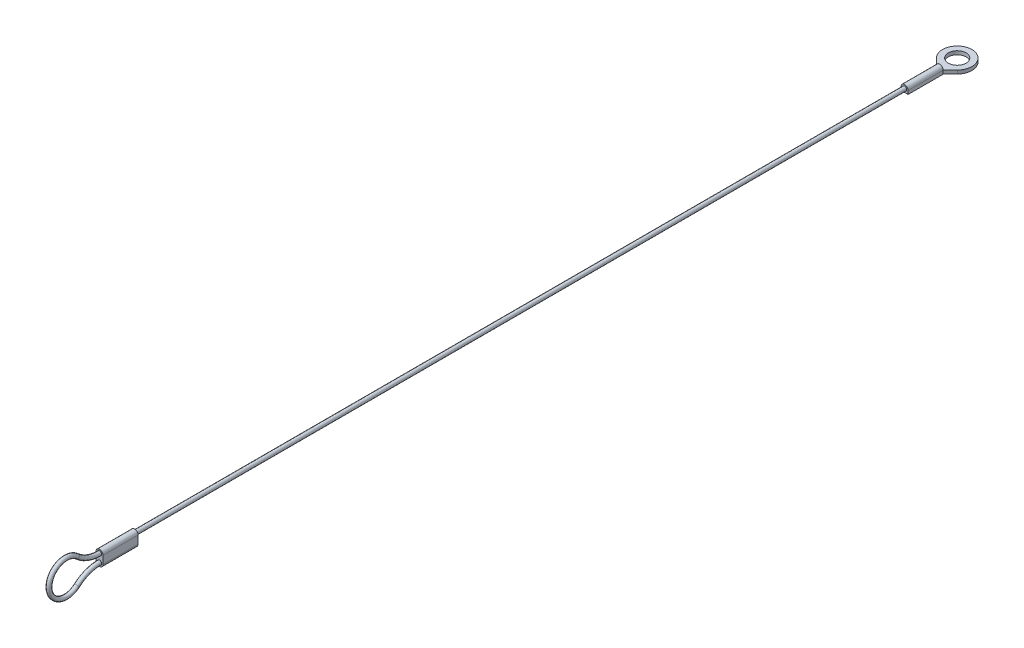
ISO-10303-21;
HEADER;
FILE_DESCRIPTION(('STEP AP214'),'2;1');
FILE_NAME('part.step','',(''),(''),'','','');
FILE_SCHEMA(('AUTOMOTIVE_DESIGN { 1 0 10303 214 1 1 1 1 }'));
ENDSEC;
DATA;
#1=APPLICATION_CONTEXT('core data for automotive mechanical design processes');
#2=APPLICATION_PROTOCOL_DEFINITION('international standard','automotive_design',2000,#1);
#3=PRODUCT_CONTEXT('',#1,'mechanical');
#4=PRODUCT('Part','Part','',(#3));
#5=PRODUCT_RELATED_PRODUCT_CATEGORY('part','',(#4));
#6=PRODUCT_DEFINITION_FORMATION('','',#4);
#7=PRODUCT_DEFINITION_CONTEXT('part definition',#1,'design');
#8=PRODUCT_DEFINITION('design','',#6,#7);
#9=PRODUCT_DEFINITION_SHAPE('','',#8);
#10=(LENGTH_UNIT() NAMED_UNIT(*) SI_UNIT(.MILLI.,.METRE.));
#11=(NAMED_UNIT(*) PLANE_ANGLE_UNIT() SI_UNIT($,.RADIAN.));
#12=(NAMED_UNIT(*) SI_UNIT($,.STERADIAN.) SOLID_ANGLE_UNIT());
#13=UNCERTAINTY_MEASURE_WITH_UNIT(LENGTH_MEASURE(1.E-05),#10,'distance_accuracy_value','');
#14=(GEOMETRIC_REPRESENTATION_CONTEXT(3) GLOBAL_UNCERTAINTY_ASSIGNED_CONTEXT((#13)) GLOBAL_UNIT_ASSIGNED_CONTEXT((#10,
#11,#12)) REPRESENTATION_CONTEXT('',''));
#15=CARTESIAN_POINT('',(0.,0.,0.));
#16=DIRECTION('',(0.,0.,1.));
#17=DIRECTION('',(1.,0.,0.));
#18=AXIS2_PLACEMENT_3D('',#15,#16,#17);
#19=CARTESIAN_POINT('',(0.,0.,-10.));
#20=DIRECTION('',(0.,0.,-1.));
#21=DIRECTION('',(-1.,0.,0.));
#22=AXIS2_PLACEMENT_3D('',#19,#20,#21);
#23=PLANE('',#22);
#24=CARTESIAN_POINT('',(0.,0.,-10.));
#25=DIRECTION('',(0.,0.,-1.));
#26=DIRECTION('',(-1.,0.,0.));
#27=AXIS2_PLACEMENT_3D('',#24,#25,#26);
#28=CIRCLE('',#27,0.995);
#29=CARTESIAN_POINT('',(-0.995,0.00749999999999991,-10.));
#30=VERTEX_POINT('',#29);
#31=CARTESIAN_POINT('',(0.995,0.00749999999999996,-10.));
#32=VERTEX_POINT('',#31);
#33=EDGE_CURVE('E178',#30,#32,#28,.T.);
#34=ORIENTED_EDGE('',*,*,#33,.T.);
#35=DIRECTION('',(-1.,0.,0.));
#36=VECTOR('',#35,1.);
#37=CARTESIAN_POINT('',(-0.995,0.015,-10.));
#38=LINE('',#37,#36);
#39=EDGE_CURVE('E135',#32,#30,#38,.T.);
#40=ORIENTED_EDGE('',*,*,#39,.T.);
#41=EDGE_LOOP('',(#34,#40));
#42=FACE_BOUND('',#41,.T.);
#43=ADVANCED_FACE('F39',(#42),#23,.T.);
#44=CARTESIAN_POINT('',(0.,0.,229.4));
#45=DIRECTION('',(0.,0.,-1.));
#46=DIRECTION('',(-1.,0.,0.));
#47=AXIS2_PLACEMENT_3D('',#44,#45,#46);
#48=CYLINDRICAL_SURFACE('',#47,0.595);
#49=CARTESIAN_POINT('',(0.,0.,219.4));
#50=DIRECTION('',(0.,0.,-1.));
#51=DIRECTION('',(0.,1.,0.));
#52=AXIS2_PLACEMENT_3D('',#49,#50,#51);
#53=CIRCLE('',#52,0.595);
#54=CARTESIAN_POINT('',(0.,0.595,219.4));
#55=VERTEX_POINT('',#54);
#56=EDGE_CURVE('E225',#55,#55,#53,.T.);
#57=ORIENTED_EDGE('',*,*,#56,.T.);
#58=EDGE_LOOP('',(#57));
#59=FACE_BOUND('',#58,.T.);
#60=CARTESIAN_POINT('',(0.,0.,0.));
#61=DIRECTION('',(0.,0.,1.));
#62=DIRECTION('',(1.,0.,0.));
#63=AXIS2_PLACEMENT_3D('',#60,#61,#62);
#64=CIRCLE('',#63,0.595);
#65=CARTESIAN_POINT('',(0.595,0.,0.));
#66=VERTEX_POINT('',#65);
#67=EDGE_CURVE('E201',#66,#66,#64,.T.);
#68=ORIENTED_EDGE('',*,*,#67,.T.);
#69=EDGE_LOOP('',(#68));
#70=FACE_BOUND('',#69,.T.);
#71=ADVANCED_FACE('F41',(#59,#70),#48,.T.);
#72=CARTESIAN_POINT('',(0.,3.17165275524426E-13,219.4));
#73=DIRECTION('',(0.,0.,1.));
#74=DIRECTION('',(0.,-1.,0.));
#75=AXIS2_PLACEMENT_3D('',#72,#73,#74);
#76=CYLINDRICAL_SURFACE('',#75,0.995);
#77=CARTESIAN_POINT('',(0.,3.31621304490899E-13,229.4));
#78=DIRECTION('',(0.,0.,-1.));
#79=DIRECTION('',(0.,1.,0.));
#80=AXIS2_PLACEMENT_3D('',#77,#78,#79);
#81=CIRCLE('',#80,0.995);
#82=CARTESIAN_POINT('',(-0.995,3.31743156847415E-13,229.4));
#83=VERTEX_POINT('',#82);
#84=CARTESIAN_POINT('',(0.995,3.31499452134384E-13,229.4));
#85=VERTEX_POINT('',#84);
#86=EDGE_CURVE('E196',#83,#85,#81,.T.);
#87=ORIENTED_EDGE('',*,*,#86,.T.);
#88=DIRECTION('',(0.,0.,1.));
#89=VECTOR('',#88,1.);
#90=CARTESIAN_POINT('',(0.995,3.17043423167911E-13,219.4));
#91=LINE('',#90,#89);
#92=CARTESIAN_POINT('',(0.995,3.17043423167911E-13,219.4));
#93=VERTEX_POINT('',#92);
#94=EDGE_CURVE('E218',#93,#85,#91,.T.);
#95=ORIENTED_EDGE('',*,*,#94,.F.);
#96=CARTESIAN_POINT('',(0.,3.17165275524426E-13,219.4));
#97=DIRECTION('',(0.,0.,-1.));
#98=DIRECTION('',(0.,1.,0.));
#99=AXIS2_PLACEMENT_3D('',#96,#97,#98);
#100=CIRCLE('',#99,0.995);
#101=CARTESIAN_POINT('',(-0.995,3.17287127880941E-13,219.4));
#102=VERTEX_POINT('',#101);
#103=EDGE_CURVE('E185',#102,#93,#100,.T.);
#104=ORIENTED_EDGE('',*,*,#103,.F.);
#105=DIRECTION('',(0.,0.,1.));
#106=VECTOR('',#105,1.);
#107=CARTESIAN_POINT('',(-0.995,3.17287127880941E-13,219.4));
#108=LINE('',#107,#106);
#109=EDGE_CURVE('E195',#102,#83,#108,.T.);
#110=ORIENTED_EDGE('',*,*,#109,.T.);
#111=EDGE_LOOP('',(#87,#95,#104,#110));
#112=FACE_BOUND('',#111,.T.);
#113=ADVANCED_FACE('F418',(#112),#76,.T.);
#114=CARTESIAN_POINT('',(0.995,3.17043423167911E-13,219.4));
#115=DIRECTION('',(-1.,0.,0.));
#116=DIRECTION('',(0.,-1.,0.));
#117=AXIS2_PLACEMENT_3D('',#114,#115,#116);
#118=PLANE('',#117);
#119=DIRECTION('',(0.,-1.,0.));
#120=VECTOR('',#119,1.);
#121=CARTESIAN_POINT('',(0.995,3.31499452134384E-13,229.4));
#122=LINE('',#121,#120);
#123=CARTESIAN_POINT('',(0.994999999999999,-2.2662525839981,229.4));
#124=VERTEX_POINT('',#123);
#125=EDGE_CURVE('E200',#85,#124,#122,.T.);
#126=ORIENTED_EDGE('',*,*,#125,.T.);
#127=DIRECTION('',(0.,0.,1.));
#128=VECTOR('',#127,1.);
#129=CARTESIAN_POINT('',(0.994999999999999,-2.26625258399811,219.4));
#130=LINE('',#129,#128);
#131=CARTESIAN_POINT('',(0.994999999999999,-2.26625258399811,219.4));
#132=VERTEX_POINT('',#131);
#133=EDGE_CURVE('E214',#132,#124,#130,.T.);
#134=ORIENTED_EDGE('',*,*,#133,.F.);
#135=DIRECTION('',(0.,-1.,0.));
#136=VECTOR('',#135,1.);
#137=CARTESIAN_POINT('',(0.995,3.17043423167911E-13,219.4));
#138=LINE('',#137,#136);
#139=EDGE_CURVE('E87',#93,#132,#138,.T.);
#140=ORIENTED_EDGE('',*,*,#139,.F.);
#141=ORIENTED_EDGE('',*,*,#94,.T.);
#142=EDGE_LOOP('',(#126,#134,#140,#141));
#143=FACE_BOUND('',#142,.T.);
#144=ADVANCED_FACE('F411',(#143),#118,.F.);
#145=CARTESIAN_POINT('',(0.,-2.26625258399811,219.4));
#146=DIRECTION('',(0.,0.,1.));
#147=DIRECTION('',(0.,-1.,0.));
#148=AXIS2_PLACEMENT_3D('',#145,#146,#147);
#149=CYLINDRICAL_SURFACE('',#148,0.995);
#150=CARTESIAN_POINT('',(0.,-2.2662525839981,229.4));
#151=DIRECTION('',(0.,0.,-1.));
#152=DIRECTION('',(0.,1.,0.));
#153=AXIS2_PLACEMENT_3D('',#150,#151,#152);
#154=CIRCLE('',#153,0.995);
#155=CARTESIAN_POINT('',(-0.995,-2.2662525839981,229.4));
#156=VERTEX_POINT('',#155);
#157=EDGE_CURVE('E204',#124,#156,#154,.T.);
#158=ORIENTED_EDGE('',*,*,#157,.T.);
#159=DIRECTION('',(0.,0.,1.));
#160=VECTOR('',#159,1.);
#161=CARTESIAN_POINT('',(-0.995,-2.26625258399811,219.4));
#162=LINE('',#161,#160);
#163=CARTESIAN_POINT('',(-0.995,-2.26625258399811,219.4));
#164=VERTEX_POINT('',#163);
#165=EDGE_CURVE('E211',#164,#156,#162,.T.);
#166=ORIENTED_EDGE('',*,*,#165,.F.);
#167=CARTESIAN_POINT('',(0.,-2.26625258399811,219.4));
#168=DIRECTION('',(0.,0.,-1.));
#169=DIRECTION('',(0.,1.,0.));
#170=AXIS2_PLACEMENT_3D('',#167,#168,#169);
#171=CIRCLE('',#170,0.995);
#172=EDGE_CURVE('E190',#132,#164,#171,.T.);
#173=ORIENTED_EDGE('',*,*,#172,.F.);
#174=ORIENTED_EDGE('',*,*,#133,.T.);
#175=EDGE_LOOP('',(#158,#166,#173,#174));
#176=FACE_BOUND('',#175,.T.);
#177=ADVANCED_FACE('F405',(#176),#149,.T.);
#178=CARTESIAN_POINT('',(-0.995,3.17287127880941E-13,219.4));
#179=DIRECTION('',(1.,0.,0.));
#180=DIRECTION('',(0.,0.,-1.));
#181=AXIS2_PLACEMENT_3D('',#178,#179,#180);
#182=PLANE('',#181);
#183=DIRECTION('',(0.,1.,0.));
#184=VECTOR('',#183,1.);
#185=CARTESIAN_POINT('',(-0.995,3.31743156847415E-13,229.4));
#186=LINE('',#185,#184);
#187=EDGE_CURVE('E79',#156,#83,#186,.T.);
#188=ORIENTED_EDGE('',*,*,#187,.T.);
#189=ORIENTED_EDGE('',*,*,#109,.F.);
#190=DIRECTION('',(0.,1.,0.));
#191=VECTOR('',#190,1.);
#192=CARTESIAN_POINT('',(-0.995,3.17287127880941E-13,219.4));
#193=LINE('',#192,#191);
#194=EDGE_CURVE('E59',#164,#102,#193,.T.);
#195=ORIENTED_EDGE('',*,*,#194,.F.);
#196=ORIENTED_EDGE('',*,*,#165,.T.);
#197=EDGE_LOOP('',(#188,#189,#195,#196));
#198=FACE_BOUND('',#197,.T.);
#199=ADVANCED_FACE('F399',(#198),#182,.F.);
#200=CARTESIAN_POINT('',(0.,3.17165275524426E-13,219.4));
#201=DIRECTION('',(0.,0.,-1.));
#202=DIRECTION('',(0.,1.,0.));
#203=AXIS2_PLACEMENT_3D('',#200,#201,#202);
#204=PLANE('',#203);
#205=ORIENTED_EDGE('',*,*,#56,.F.);
#206=EDGE_LOOP('',(#205));
#207=FACE_BOUND('',#206,.T.);
#208=ORIENTED_EDGE('',*,*,#103,.T.);
#209=ORIENTED_EDGE('',*,*,#139,.T.);
#210=ORIENTED_EDGE('',*,*,#172,.T.);
#211=ORIENTED_EDGE('',*,*,#194,.T.);
#212=EDGE_LOOP('',(#208,#209,#210,#211));
#213=FACE_BOUND('',#212,.T.);
#214=ADVANCED_FACE('F278',(#207,#213),#204,.T.);
#215=CARTESIAN_POINT('',(0.,3.31621304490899E-13,229.4));
#216=DIRECTION('',(0.,0.,-1.));
#217=DIRECTION('',(0.,1.,0.));
#218=AXIS2_PLACEMENT_3D('',#215,#216,#217);
#219=PLANE('',#218);
#220=CARTESIAN_POINT('',(0.,-2.2662525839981,229.4));
#221=DIRECTION('',(0.,0.,-1.));
#222=DIRECTION('',(1.,0.,0.));
#223=AXIS2_PLACEMENT_3D('',#220,#221,#222);
#224=CIRCLE('',#223,0.595);
#225=CARTESIAN_POINT('',(0.,-1.6712525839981,229.4));
#226=VERTEX_POINT('',#225);
#227=EDGE_CURVE('E226',#226,#226,#224,.T.);
#228=ORIENTED_EDGE('',*,*,#227,.T.);
#229=EDGE_LOOP('',(#228));
#230=FACE_BOUND('',#229,.T.);
#231=CARTESIAN_POINT('',(0.,0.,229.4));
#232=DIRECTION('',(0.,0.,-1.));
#233=DIRECTION('',(0.,1.,0.));
#234=AXIS2_PLACEMENT_3D('',#231,#232,#233);
#235=CIRCLE('',#234,0.595);
#236=CARTESIAN_POINT('',(0.,-0.595000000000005,229.4));
#237=VERTEX_POINT('',#236);
#238=EDGE_CURVE('E221',#237,#237,#235,.T.);
#239=ORIENTED_EDGE('',*,*,#238,.T.);
#240=EDGE_LOOP('',(#239));
#241=FACE_BOUND('',#240,.T.);
#242=ORIENTED_EDGE('',*,*,#86,.F.);
#243=ORIENTED_EDGE('',*,*,#187,.F.);
#244=ORIENTED_EDGE('',*,*,#157,.F.);
#245=ORIENTED_EDGE('',*,*,#125,.F.);
#246=EDGE_LOOP('',(#242,#243,#244,#245));
#247=FACE_BOUND('',#246,.T.);
#248=ADVANCED_FACE('F387',(#230,#241,#247),#219,.F.);
#249=CARTESIAN_POINT('',(0.,-11.8662525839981,229.4));
#250=DIRECTION('',(1.,0.,0.));
#251=DIRECTION('',(0.,0.,-1.));
#252=AXIS2_PLACEMENT_3D('',#249,#250,#251);
#253=TOROIDAL_SURFACE('',#252,9.59999999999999,0.595);
#254=CARTESIAN_POINT('',(0.,-4.71083505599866,235.8));
#255=DIRECTION('',(0.,0.666666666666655,-0.74535599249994));
#256=DIRECTION('',(1.,0.,0.));
#257=AXIS2_PLACEMENT_3D('',#254,#255,#256);
#258=CIRCLE('',#257,0.595);
#259=CARTESIAN_POINT('',(0.,-4.2673482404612,236.196666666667));
#260=VERTEX_POINT('',#259);
#261=EDGE_CURVE('E50',#260,#260,#258,.T.);
#262=CARTESIAN_POINT('',(0.,-11.8662525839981,229.4));
#263=DIRECTION('',(1.,0.,0.));
#264=DIRECTION('',(0.,0.,-1.));
#265=AXIS2_PLACEMENT_3D('',#262,#263,#264);
#266=CIRCLE('',#265,10.195);
#267=EDGE_CURVE('',#226,#260,#266,.T.);
#268=ORIENTED_EDGE('',*,*,#227,.F.);
#269=ORIENTED_EDGE('',*,*,#261,.T.);
#270=ORIENTED_EDGE('',*,*,#267,.T.);
#271=ORIENTED_EDGE('',*,*,#267,.F.);
#272=EDGE_LOOP('',(#268,#270,#269,#271));
#273=FACE_BOUND('',#272,.T.);
#274=ADVANCED_FACE('F380',(#273),#253,.T.);
#275=CARTESIAN_POINT('',(0.,-1.13312629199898,239.));
#276=DIRECTION('',(-1.,0.,0.));
#277=DIRECTION('',(0.,0.,1.));
#278=AXIS2_PLACEMENT_3D('',#275,#276,#277);
#279=TOROIDAL_SURFACE('',#278,4.79999999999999,0.595);
#280=CARTESIAN_POINT('',(0.,2.44458247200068,235.8));
#281=DIRECTION('',(0.,0.666666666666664,0.745355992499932));
#282=DIRECTION('',(1.,0.,0.));
#283=AXIS2_PLACEMENT_3D('',#280,#281,#282);
#284=CIRCLE('',#283,0.595);
#285=CARTESIAN_POINT('',(0.,2.00109565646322,236.196666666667));
#286=VERTEX_POINT('',#285);
#287=EDGE_CURVE('E11',#286,#286,#284,.T.);
#288=ORIENTED_EDGE('',*,*,#287,.T.);
#289=EDGE_LOOP('',(#288));
#290=FACE_BOUND('',#289,.T.);
#291=ORIENTED_EDGE('',*,*,#261,.F.);
#292=EDGE_LOOP('',(#291));
#293=FACE_BOUND('',#292,.T.);
#294=ADVANCED_FACE('F374',(#290,#293),#279,.T.);
#295=CARTESIAN_POINT('',(0.,9.6,229.4));
#296=DIRECTION('',(1.,0.,0.));
#297=DIRECTION('',(0.,0.,-1.));
#298=AXIS2_PLACEMENT_3D('',#295,#296,#297);
#299=TOROIDAL_SURFACE('',#298,9.6,0.595);
#300=CARTESIAN_POINT('',(0.,9.6,229.4));
#301=DIRECTION('',(1.,0.,0.));
#302=DIRECTION('',(0.,0.,-1.));
#303=AXIS2_PLACEMENT_3D('',#300,#301,#302);
#304=CIRCLE('',#303,10.195);
#305=EDGE_CURVE('',#286,#237,#304,.T.);
#306=ORIENTED_EDGE('',*,*,#287,.F.);
#307=ORIENTED_EDGE('',*,*,#238,.F.);
#308=ORIENTED_EDGE('',*,*,#305,.T.);
#309=ORIENTED_EDGE('',*,*,#305,.F.);
#310=EDGE_LOOP('',(#306,#308,#307,#309));
#311=FACE_BOUND('',#310,.T.);
#312=ADVANCED_FACE('F276',(#311),#299,.T.);
#313=CARTESIAN_POINT('',(0.,0.,-10.));
#314=DIRECTION('',(0.,0.,1.));
#315=DIRECTION('',(1.,0.,0.));
#316=AXIS2_PLACEMENT_3D('',#313,#314,#315);
#317=CYLINDRICAL_SURFACE('',#316,0.995);
#318=CARTESIAN_POINT('',(0.,0.,0.));
#319=DIRECTION('',(0.,0.,-1.));
#320=DIRECTION('',(-1.,0.,0.));
#321=AXIS2_PLACEMENT_3D('',#318,#319,#320);
#322=CIRCLE('',#321,0.995);
#323=CARTESIAN_POINT('',(-0.995,0.,0.));
#324=VERTEX_POINT('',#323);
#325=CARTESIAN_POINT('',(0.995,0.,0.));
#326=VERTEX_POINT('',#325);
#327=EDGE_CURVE('E164',#324,#326,#322,.T.);
#328=ORIENTED_EDGE('',*,*,#327,.T.);
#329=DIRECTION('',(0.,0.,1.));
#330=VECTOR('',#329,1.);
#331=CARTESIAN_POINT('',(0.995,0.,-10.));
#332=LINE('',#331,#330);
#333=EDGE_CURVE('E236',#32,#326,#332,.T.);
#334=ORIENTED_EDGE('',*,*,#333,.F.);
#335=ORIENTED_EDGE('',*,*,#33,.F.);
#336=DIRECTION('',(0.,0.,1.));
#337=VECTOR('',#336,1.);
#338=CARTESIAN_POINT('',(-0.995,0.,-10.));
#339=LINE('',#338,#337);
#340=EDGE_CURVE('E184',#30,#324,#339,.T.);
#341=ORIENTED_EDGE('',*,*,#340,.T.);
#342=EDGE_LOOP('',(#328,#334,#335,#341));
#343=FACE_BOUND('',#342,.T.);
#344=ADVANCED_FACE('F271',(#343),#317,.T.);
#345=CARTESIAN_POINT('',(0.995,0.,-10.));
#346=DIRECTION('',(-1.,0.,0.));
#347=DIRECTION('',(0.,-1.,0.));
#348=AXIS2_PLACEMENT_3D('',#345,#346,#347);
#349=PLANE('',#348);
#350=DIRECTION('',(0.,-1.,0.));
#351=VECTOR('',#350,1.);
#352=CARTESIAN_POINT('',(0.995,0.,0.));
#353=LINE('',#352,#351);
#354=CARTESIAN_POINT('',(0.995,-0.995,0.));
#355=VERTEX_POINT('',#354);
#356=EDGE_CURVE('E168',#326,#355,#353,.T.);
#357=ORIENTED_EDGE('',*,*,#356,.T.);
#358=DIRECTION('',(0.,0.,1.));
#359=VECTOR('',#358,1.);
#360=CARTESIAN_POINT('',(0.995,-0.995,-10.));
#361=LINE('',#360,#359);
#362=CARTESIAN_POINT('',(0.995,-0.995,-10.));
#363=VERTEX_POINT('',#362);
#364=EDGE_CURVE('E183',#363,#355,#361,.T.);
#365=ORIENTED_EDGE('',*,*,#364,.F.);
#366=DIRECTION('',(0.,-1.,0.));
#367=VECTOR('',#366,1.);
#368=CARTESIAN_POINT('',(0.995,0.,-10.));
#369=LINE('',#368,#367);
#370=EDGE_CURVE('E247',#32,#363,#369,.T.);
#371=ORIENTED_EDGE('',*,*,#370,.F.);
#372=ORIENTED_EDGE('',*,*,#333,.T.);
#373=EDGE_LOOP('',(#357,#365,#371,#372));
#374=FACE_BOUND('',#373,.T.);
#375=ADVANCED_FACE('F260',(#374),#349,.F.);
#376=CARTESIAN_POINT('',(0.,-0.995,-10.));
#377=DIRECTION('',(0.,1.,0.));
#378=DIRECTION('',(0.,0.,1.));
#379=AXIS2_PLACEMENT_3D('',#376,#377,#378);
#380=PLANE('',#379);
#381=DIRECTION('',(-1.,0.,0.));
#382=VECTOR('',#381,1.);
#383=CARTESIAN_POINT('',(0.,-0.995,0.));
#384=LINE('',#383,#382);
#385=CARTESIAN_POINT('',(-0.995,-0.995,0.));
#386=VERTEX_POINT('',#385);
#387=EDGE_CURVE('E172',#355,#386,#384,.T.);
#388=ORIENTED_EDGE('',*,*,#387,.T.);
#389=DIRECTION('',(0.,0.,1.));
#390=VECTOR('',#389,1.);
#391=CARTESIAN_POINT('',(-0.995,-0.995,-10.));
#392=LINE('',#391,#390);
#393=CARTESIAN_POINT('',(-0.995,-0.995,-10.));
#394=VERTEX_POINT('',#393);
#395=EDGE_CURVE('E179',#394,#386,#392,.T.);
#396=ORIENTED_EDGE('',*,*,#395,.F.);
#397=DIRECTION('',(-0.69489731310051,0.,-0.719108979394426));
#398=VECTOR('',#397,1.);
#399=CARTESIAN_POINT('',(-3.01306662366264,-0.995,-12.0883802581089));
#400=LINE('',#399,#398);
#401=CARTESIAN_POINT('',(-3.01306662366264,-0.995,-12.0883802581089));
#402=VERTEX_POINT('',#401);
#403=EDGE_CURVE('E512',#394,#402,#400,.T.);
#404=ORIENTED_EDGE('',*,*,#403,.T.);
#405=CARTESIAN_POINT('',(0.,-0.995,-15.));
#406=DIRECTION('',(0.,-1.,0.));
#407=DIRECTION('',(0.,0.,1.));
#408=AXIS2_PLACEMENT_3D('',#405,#406,#407);
#409=CIRCLE('',#408,4.19);
#410=CARTESIAN_POINT('',(3.01306662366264,-0.995,-12.0883802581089));
#411=VERTEX_POINT('',#410);
#412=EDGE_CURVE('E129',#402,#411,#409,.T.);
#413=ORIENTED_EDGE('',*,*,#412,.T.);
#414=DIRECTION('',(-0.69489731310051,0.,0.719108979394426));
#415=VECTOR('',#414,1.);
#416=CARTESIAN_POINT('',(0.995,-0.995,-10.));
#417=LINE('',#416,#415);
#418=EDGE_CURVE('E152',#411,#363,#417,.T.);
#419=ORIENTED_EDGE('',*,*,#418,.T.);
#420=ORIENTED_EDGE('',*,*,#364,.T.);
#421=EDGE_LOOP('',(#388,#396,#404,#413,#419,#420));
#422=FACE_BOUND('',#421,.T.);
#423=CARTESIAN_POINT('',(0.,-0.995,-15.));
#424=DIRECTION('',(0.,-1.,0.));
#425=DIRECTION('',(0.,0.,-1.));
#426=AXIS2_PLACEMENT_3D('',#423,#424,#425);
#427=CIRCLE('',#426,2.54);
#428=CARTESIAN_POINT('',(0.,-0.995,-17.54));
#429=VERTEX_POINT('',#428);
#430=EDGE_CURVE('E509',#429,#429,#427,.T.);
#431=ORIENTED_EDGE('',*,*,#430,.F.);
#432=EDGE_LOOP('',(#431));
#433=FACE_BOUND('',#432,.T.);
#434=ADVANCED_FACE('F270',(#422,#433),#380,.F.);
#435=CARTESIAN_POINT('',(-0.995,-0.995,-10.));
#436=DIRECTION('',(1.,0.,0.));
#437=DIRECTION('',(0.,1.,0.));
#438=AXIS2_PLACEMENT_3D('',#435,#436,#437);
#439=PLANE('',#438);
#440=DIRECTION('',(0.,1.,0.));
#441=VECTOR('',#440,1.);
#442=CARTESIAN_POINT('',(-0.995,-0.995,0.));
#443=LINE('',#442,#441);
#444=EDGE_CURVE('E175',#386,#324,#443,.T.);
#445=ORIENTED_EDGE('',*,*,#444,.T.);
#446=ORIENTED_EDGE('',*,*,#340,.F.);
#447=DIRECTION('',(0.,1.,0.));
#448=VECTOR('',#447,1.);
#449=CARTESIAN_POINT('',(-0.995,-0.995,-10.));
#450=LINE('',#449,#448);
#451=EDGE_CURVE('E149',#394,#30,#450,.T.);
#452=ORIENTED_EDGE('',*,*,#451,.F.);
#453=ORIENTED_EDGE('',*,*,#395,.T.);
#454=EDGE_LOOP('',(#445,#446,#452,#453));
#455=FACE_BOUND('',#454,.T.);
#456=ADVANCED_FACE('F313',(#455),#439,.F.);
#457=CARTESIAN_POINT('',(0.,0.,0.));
#458=DIRECTION('',(0.,0.,-1.));
#459=DIRECTION('',(-1.,0.,0.));
#460=AXIS2_PLACEMENT_3D('',#457,#458,#459);
#461=PLANE('',#460);
#462=ORIENTED_EDGE('',*,*,#67,.F.);
#463=EDGE_LOOP('',(#462));
#464=FACE_BOUND('',#463,.T.);
#465=ORIENTED_EDGE('',*,*,#327,.F.);
#466=ORIENTED_EDGE('',*,*,#444,.F.);
#467=ORIENTED_EDGE('',*,*,#387,.F.);
#468=ORIENTED_EDGE('',*,*,#356,.F.);
#469=EDGE_LOOP('',(#465,#466,#467,#468));
#470=FACE_BOUND('',#469,.T.);
#471=ADVANCED_FACE('F309',(#464,#470),#461,.F.);
#472=CARTESIAN_POINT('',(-3.01306662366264,0.015,-12.0883802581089));
#473=DIRECTION('',(-0.719108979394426,0.,0.69489731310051));
#474=DIRECTION('',(0.69489731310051,0.,0.719108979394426));
#475=AXIS2_PLACEMENT_3D('',#472,#473,#474);
#476=PLANE('',#475);
#477=ORIENTED_EDGE('',*,*,#403,.F.);
#478=ORIENTED_EDGE('',*,*,#451,.T.);
#479=DIRECTION('',(-0.69489731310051,0.,-0.719108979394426));
#480=VECTOR('',#479,1.);
#481=CARTESIAN_POINT('',(-3.01306662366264,0.015,-12.0883802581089));
#482=LINE('',#481,#480);
#483=CARTESIAN_POINT('',(-3.01306662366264,0.015,-12.0883802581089));
#484=VERTEX_POINT('',#483);
#485=EDGE_CURVE('E142',#30,#484,#482,.T.);
#486=ORIENTED_EDGE('',*,*,#485,.T.);
#487=DIRECTION('',(0.,-1.,0.));
#488=VECTOR('',#487,1.);
#489=CARTESIAN_POINT('',(-3.01306662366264,0.015,-12.0883802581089));
#490=LINE('',#489,#488);
#491=EDGE_CURVE('E124',#484,#402,#490,.T.);
#492=ORIENTED_EDGE('',*,*,#491,.T.);
#493=EDGE_LOOP('',(#477,#478,#486,#492));
#494=FACE_BOUND('',#493,.T.);
#495=ADVANCED_FACE('F147',(#494),#476,.T.);
#496=CARTESIAN_POINT('',(0.995,0.015,-10.));
#497=DIRECTION('',(0.719108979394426,0.,0.69489731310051));
#498=DIRECTION('',(0.69489731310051,0.,-0.719108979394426));
#499=AXIS2_PLACEMENT_3D('',#496,#497,#498);
#500=PLANE('',#499);
#501=ORIENTED_EDGE('',*,*,#418,.F.);
#502=DIRECTION('',(0.,-1.,0.));
#503=VECTOR('',#502,1.);
#504=CARTESIAN_POINT('',(3.01306662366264,0.015,-12.0883802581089));
#505=LINE('',#504,#503);
#506=CARTESIAN_POINT('',(3.01306662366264,0.015,-12.0883802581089));
#507=VERTEX_POINT('',#506);
#508=EDGE_CURVE('E134',#507,#411,#505,.T.);
#509=ORIENTED_EDGE('',*,*,#508,.F.);
#510=DIRECTION('',(-0.69489731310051,0.,0.719108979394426));
#511=VECTOR('',#510,1.);
#512=CARTESIAN_POINT('',(0.995,0.015,-10.));
#513=LINE('',#512,#511);
#514=EDGE_CURVE('E144',#507,#32,#513,.T.);
#515=ORIENTED_EDGE('',*,*,#514,.T.);
#516=ORIENTED_EDGE('',*,*,#370,.T.);
#517=EDGE_LOOP('',(#501,#509,#515,#516));
#518=FACE_BOUND('',#517,.T.);
#519=ADVANCED_FACE('F329',(#518),#500,.T.);
#520=CARTESIAN_POINT('',(0.,0.015,-15.));
#521=DIRECTION('',(0.,-1.,0.));
#522=DIRECTION('',(0.,0.,-1.));
#523=AXIS2_PLACEMENT_3D('',#520,#521,#522);
#524=CYLINDRICAL_SURFACE('',#523,4.19);
#525=ORIENTED_EDGE('',*,*,#412,.F.);
#526=ORIENTED_EDGE('',*,*,#491,.F.);
#527=CARTESIAN_POINT('',(0.,0.015,-15.));
#528=DIRECTION('',(0.,-1.,0.));
#529=DIRECTION('',(0.,0.,1.));
#530=AXIS2_PLACEMENT_3D('',#527,#528,#529);
#531=CIRCLE('',#530,4.19);
#532=EDGE_CURVE('E127',#484,#507,#531,.T.);
#533=ORIENTED_EDGE('',*,*,#532,.T.);
#534=ORIENTED_EDGE('',*,*,#508,.T.);
#535=EDGE_LOOP('',(#525,#526,#533,#534));
#536=FACE_BOUND('',#535,.T.);
#537=ADVANCED_FACE('F126',(#536),#524,.T.);
#538=CARTESIAN_POINT('',(0.,0.015,-15.));
#539=DIRECTION('',(0.,1.,0.));
#540=DIRECTION('',(0.,0.,1.));
#541=AXIS2_PLACEMENT_3D('',#538,#539,#540);
#542=PLANE('',#541);
#543=CARTESIAN_POINT('',(0.,0.015,-15.));
#544=DIRECTION('',(0.,-1.,0.));
#545=DIRECTION('',(0.,0.,-1.));
#546=AXIS2_PLACEMENT_3D('',#543,#544,#545);
#547=CIRCLE('',#546,2.54);
#548=CARTESIAN_POINT('',(0.,0.015,-17.54));
#549=VERTEX_POINT('',#548);
#550=EDGE_CURVE('E506',#549,#549,#547,.T.);
#551=ORIENTED_EDGE('',*,*,#550,.T.);
#552=EDGE_LOOP('',(#551));
#553=FACE_BOUND('',#552,.T.);
#554=ORIENTED_EDGE('',*,*,#485,.F.);
#555=ORIENTED_EDGE('',*,*,#39,.F.);
#556=ORIENTED_EDGE('',*,*,#514,.F.);
#557=ORIENTED_EDGE('',*,*,#532,.F.);
#558=EDGE_LOOP('',(#554,#555,#556,#557));
#559=FACE_BOUND('',#558,.T.);
#560=ADVANCED_FACE('F140',(#553,#559),#542,.T.);
#561=CARTESIAN_POINT('',(0.,0.015,-15.));
#562=DIRECTION('',(0.,-1.,0.));
#563=DIRECTION('',(0.,0.,-1.));
#564=AXIS2_PLACEMENT_3D('',#561,#562,#563);
#565=CYLINDRICAL_SURFACE('',#564,2.54);
#566=ORIENTED_EDGE('',*,*,#550,.F.);
#567=EDGE_LOOP('',(#566));
#568=FACE_BOUND('',#567,.T.);
#569=ORIENTED_EDGE('',*,*,#430,.T.);
#570=EDGE_LOOP('',(#569));
#571=FACE_BOUND('',#570,.T.);
#572=ADVANCED_FACE('F486',(#568,#571),#565,.F.);
#573=CLOSED_SHELL('',(#43,#71,#113,#144,#177,#199,#214,#248,#274,#294,#312,#344,#375,#434,#456,
#471,#495,#519,#537,#560,#572));
#574=MANIFOLD_SOLID_BREP('B2',#573);
#575=ADVANCED_BREP_SHAPE_REPRESENTATION('',(#18,#574),#14);
#576=SHAPE_DEFINITION_REPRESENTATION(#9,#575);
ENDSEC;
END-ISO-10303-21;
